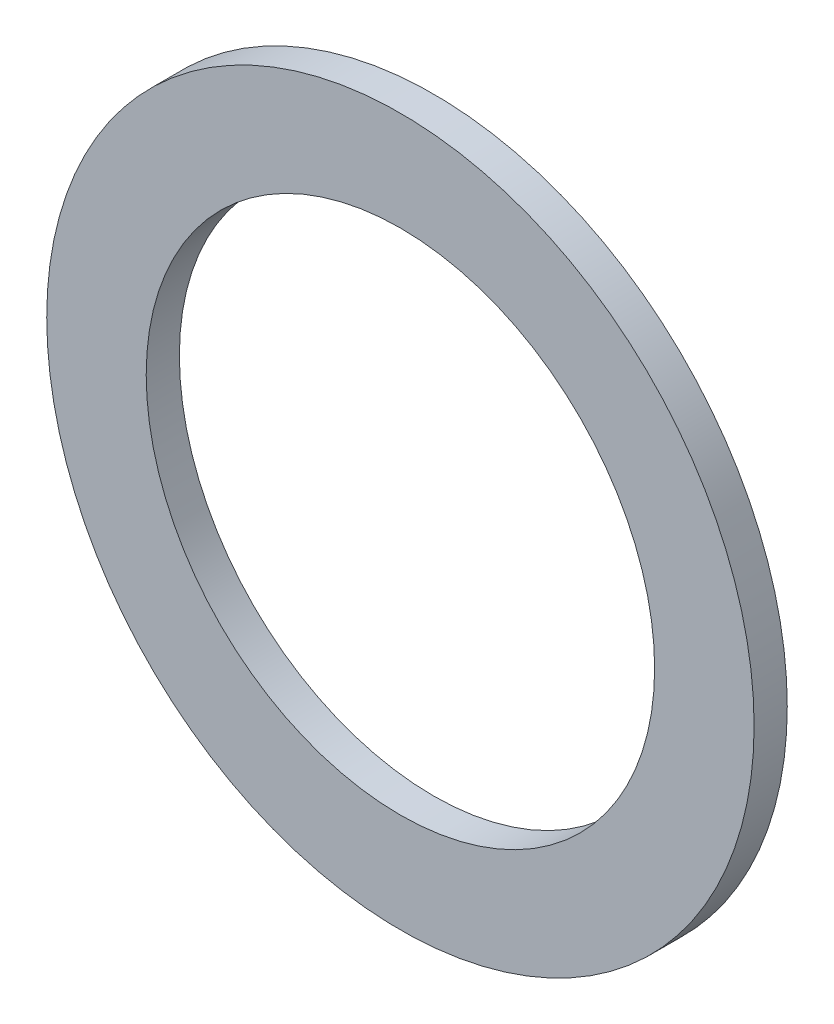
from build123d import *

# Parameters (mm, degrees)
ESQUISSE1_R          = 32
ESQUISSE1_R_2        = 23
BASE_EXTRUSION_DEPTH = 3


with BuildPart() as part:
    # Esquisse1 → Base-Extrusion (new body)
    with BuildSketch(Plane.XY):
        Circle(ESQUISSE1_R)
        Circle(ESQUISSE1_R_2, mode=Mode.SUBTRACT)
    extrude(amount=BASE_EXTRUSION_DEPTH)


solid = part.part
